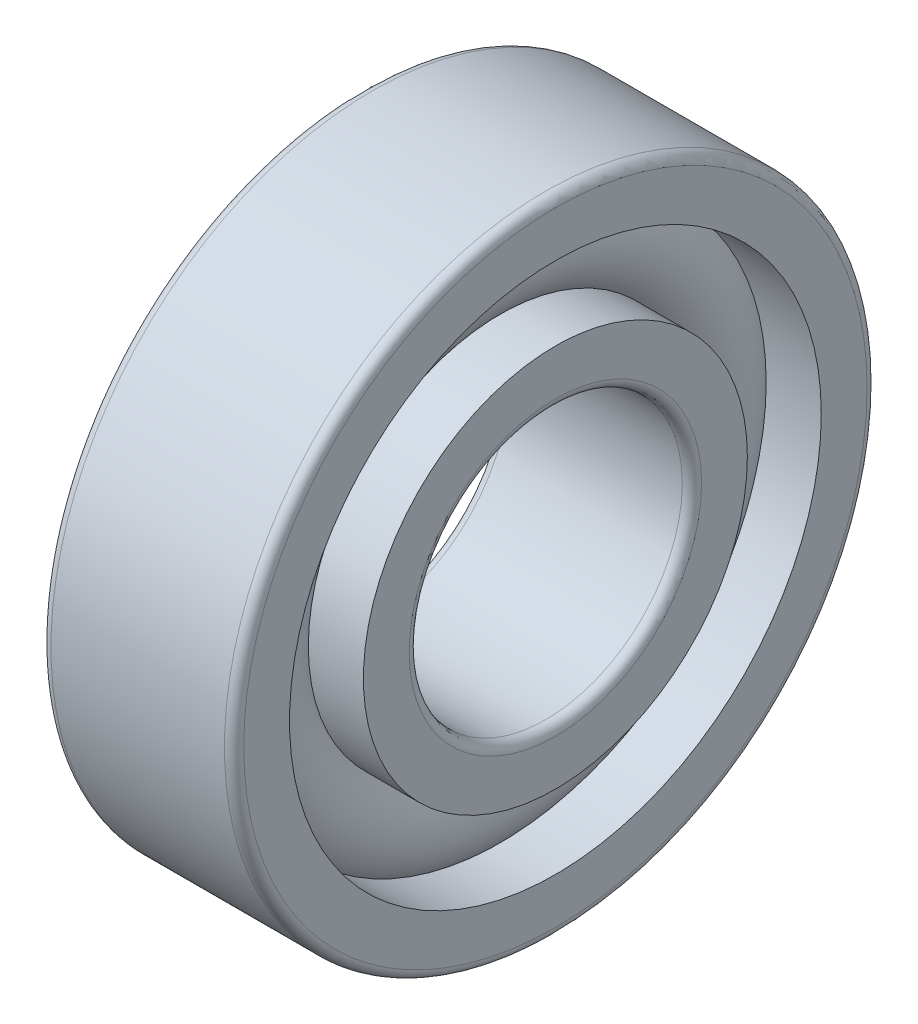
ISO-10303-21;
HEADER;
FILE_DESCRIPTION(('STEP AP214'),'2;1');
FILE_NAME('part.step','',(''),(''),'','','');
FILE_SCHEMA(('AUTOMOTIVE_DESIGN { 1 0 10303 214 1 1 1 1 }'));
ENDSEC;
DATA;
#1=APPLICATION_CONTEXT('core data for automotive mechanical design processes');
#2=APPLICATION_PROTOCOL_DEFINITION('international standard','automotive_design',2000,#1);
#3=PRODUCT_CONTEXT('',#1,'mechanical');
#4=PRODUCT('Part','Part','',(#3));
#5=PRODUCT_RELATED_PRODUCT_CATEGORY('part','',(#4));
#6=PRODUCT_DEFINITION_FORMATION('','',#4);
#7=PRODUCT_DEFINITION_CONTEXT('part definition',#1,'design');
#8=PRODUCT_DEFINITION('design','',#6,#7);
#9=PRODUCT_DEFINITION_SHAPE('','',#8);
#10=(LENGTH_UNIT() NAMED_UNIT(*) SI_UNIT(.MILLI.,.METRE.));
#11=(NAMED_UNIT(*) PLANE_ANGLE_UNIT() SI_UNIT($,.RADIAN.));
#12=(NAMED_UNIT(*) SI_UNIT($,.STERADIAN.) SOLID_ANGLE_UNIT());
#13=UNCERTAINTY_MEASURE_WITH_UNIT(LENGTH_MEASURE(1.E-05),#10,'distance_accuracy_value','');
#14=(GEOMETRIC_REPRESENTATION_CONTEXT(3) GLOBAL_UNCERTAINTY_ASSIGNED_CONTEXT((#13)) GLOBAL_UNIT_ASSIGNED_CONTEXT((#10,
#11,#12)) REPRESENTATION_CONTEXT('',''));
#15=CARTESIAN_POINT('',(0.,0.,0.));
#16=DIRECTION('',(0.,0.,1.));
#17=DIRECTION('',(1.,0.,0.));
#18=AXIS2_PLACEMENT_3D('',#15,#16,#17);
#19=CARTESIAN_POINT('',(0.,0.,0.));
#20=DIRECTION('',(-1.,0.,0.));
#21=DIRECTION('',(0.,0.,1.));
#22=AXIS2_PLACEMENT_3D('',#19,#20,#21);
#23=TOROIDAL_SURFACE('',#22,14.25,3.45);
#24=CARTESIAN_POINT('',(2.57147817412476,0.,0.));
#25=DIRECTION('',(-1.,0.,0.));
#26=DIRECTION('',(0.,0.,1.));
#27=AXIS2_PLACEMENT_3D('',#24,#25,#26);
#28=CIRCLE('',#27,16.55);
#29=CARTESIAN_POINT('',(2.57147817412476,0.,16.55));
#30=VERTEX_POINT('',#29);
#31=EDGE_CURVE('E33',#30,#30,#28,.F.);
#32=ORIENTED_EDGE('',*,*,#31,.T.);
#33=EDGE_LOOP('',(#32));
#34=FACE_BOUND('',#33,.T.);
#35=CARTESIAN_POINT('',(2.57147817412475,0.,0.));
#36=DIRECTION('',(-1.,0.,0.));
#37=DIRECTION('',(0.,0.,1.));
#38=AXIS2_PLACEMENT_3D('',#35,#36,#37);
#39=CIRCLE('',#38,11.95);
#40=CARTESIAN_POINT('',(2.57147817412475,0.,11.95));
#41=VERTEX_POINT('',#40);
#42=EDGE_CURVE('E10',#41,#41,#39,.T.);
#43=ORIENTED_EDGE('',*,*,#42,.T.);
#44=EDGE_LOOP('',(#43));
#45=FACE_BOUND('',#44,.T.);
#46=ADVANCED_FACE('F29',(#34,#45),#23,.T.);
#47=CARTESIAN_POINT('',(-20.6375,0.,0.));
#48=DIRECTION('',(1.,0.,0.));
#49=DIRECTION('',(0.,0.,-1.));
#50=AXIS2_PLACEMENT_3D('',#47,#48,#49);
#51=CYLINDRICAL_SURFACE('',#50,11.95);
#52=CARTESIAN_POINT('',(6.,0.,0.));
#53=DIRECTION('',(1.,0.,0.));
#54=DIRECTION('',(0.,0.,-1.));
#55=AXIS2_PLACEMENT_3D('',#52,#53,#54);
#56=CIRCLE('',#55,11.95);
#57=CARTESIAN_POINT('',(6.,0.,-11.95));
#58=VERTEX_POINT('',#57);
#59=EDGE_CURVE('E42',#58,#58,#56,.T.);
#60=ORIENTED_EDGE('',*,*,#59,.F.);
#61=EDGE_LOOP('',(#60));
#62=FACE_BOUND('',#61,.T.);
#63=ORIENTED_EDGE('',*,*,#42,.F.);
#64=EDGE_LOOP('',(#63));
#65=FACE_BOUND('',#64,.T.);
#66=ADVANCED_FACE('F81',(#62,#65),#51,.T.);
#67=CARTESIAN_POINT('',(-20.6375,0.,0.));
#68=DIRECTION('',(1.,0.,0.));
#69=DIRECTION('',(0.,0.,-1.));
#70=AXIS2_PLACEMENT_3D('',#67,#68,#69);
#71=CYLINDRICAL_SURFACE('',#70,11.95);
#72=CARTESIAN_POINT('',(-6.,0.,0.));
#73=DIRECTION('',(1.,0.,0.));
#74=DIRECTION('',(0.,0.,-1.));
#75=AXIS2_PLACEMENT_3D('',#72,#73,#74);
#76=CIRCLE('',#75,11.95);
#77=CARTESIAN_POINT('',(-6.,0.,-11.95));
#78=VERTEX_POINT('',#77);
#79=EDGE_CURVE('E51',#78,#78,#76,.T.);
#80=ORIENTED_EDGE('',*,*,#79,.T.);
#81=EDGE_LOOP('',(#80));
#82=FACE_BOUND('',#81,.T.);
#83=CARTESIAN_POINT('',(-2.57147817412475,0.,0.));
#84=DIRECTION('',(1.,0.,0.));
#85=DIRECTION('',(0.,0.,-1.));
#86=AXIS2_PLACEMENT_3D('',#83,#84,#85);
#87=CIRCLE('',#86,11.95);
#88=CARTESIAN_POINT('',(-2.57147817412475,0.,-11.95));
#89=VERTEX_POINT('',#88);
#90=EDGE_CURVE('E37',#89,#89,#87,.T.);
#91=ORIENTED_EDGE('',*,*,#90,.F.);
#92=EDGE_LOOP('',(#91));
#93=FACE_BOUND('',#92,.T.);
#94=ADVANCED_FACE('F84',(#82,#93),#71,.T.);
#95=CARTESIAN_POINT('',(6.,9.1,0.));
#96=DIRECTION('',(1.,0.,0.));
#97=DIRECTION('',(0.,0.,-1.));
#98=AXIS2_PLACEMENT_3D('',#95,#96,#97);
#99=PLANE('',#98);
#100=ORIENTED_EDGE('',*,*,#59,.T.);
#101=EDGE_LOOP('',(#100));
#102=FACE_BOUND('',#101,.T.);
#103=CARTESIAN_POINT('',(6.,0.,0.));
#104=DIRECTION('',(1.,0.,0.));
#105=DIRECTION('',(0.,0.,-1.));
#106=AXIS2_PLACEMENT_3D('',#103,#104,#105);
#107=CIRCLE('',#106,9.1);
#108=CARTESIAN_POINT('',(6.,0.,-9.1));
#109=VERTEX_POINT('',#108);
#110=EDGE_CURVE('E73',#109,#109,#107,.T.);
#111=ORIENTED_EDGE('',*,*,#110,.F.);
#112=EDGE_LOOP('',(#111));
#113=FACE_BOUND('',#112,.T.);
#114=ADVANCED_FACE('F78',(#102,#113),#99,.T.);
#115=CARTESIAN_POINT('',(5.4,0.,0.));
#116=DIRECTION('',(1.,0.,0.));
#117=DIRECTION('',(0.,0.,-1.));
#118=AXIS2_PLACEMENT_3D('',#115,#116,#117);
#119=TOROIDAL_SURFACE('',#118,9.1,0.6);
#120=ORIENTED_EDGE('',*,*,#110,.T.);
#121=EDGE_LOOP('',(#120));
#122=FACE_BOUND('',#121,.T.);
#123=CARTESIAN_POINT('',(5.4,0.,0.));
#124=DIRECTION('',(1.,0.,0.));
#125=DIRECTION('',(0.,0.,-1.));
#126=AXIS2_PLACEMENT_3D('',#123,#124,#125);
#127=CIRCLE('',#126,8.5);
#128=CARTESIAN_POINT('',(5.4,0.,-8.5));
#129=VERTEX_POINT('',#128);
#130=EDGE_CURVE('E70',#129,#129,#127,.T.);
#131=ORIENTED_EDGE('',*,*,#130,.F.);
#132=EDGE_LOOP('',(#131));
#133=FACE_BOUND('',#132,.T.);
#134=ADVANCED_FACE('F95',(#122,#133),#119,.T.);
#135=CARTESIAN_POINT('',(-20.6375,0.,0.));
#136=DIRECTION('',(1.,0.,0.));
#137=DIRECTION('',(0.,0.,-1.));
#138=AXIS2_PLACEMENT_3D('',#135,#136,#137);
#139=CYLINDRICAL_SURFACE('',#138,8.5);
#140=ORIENTED_EDGE('',*,*,#130,.T.);
#141=EDGE_LOOP('',(#140));
#142=FACE_BOUND('',#141,.T.);
#143=CARTESIAN_POINT('',(-5.4,0.,0.));
#144=DIRECTION('',(1.,0.,0.));
#145=DIRECTION('',(0.,0.,-1.));
#146=AXIS2_PLACEMENT_3D('',#143,#144,#145);
#147=CIRCLE('',#146,8.5);
#148=CARTESIAN_POINT('',(-5.4,0.,-8.5));
#149=VERTEX_POINT('',#148);
#150=EDGE_CURVE('E67',#149,#149,#147,.T.);
#151=ORIENTED_EDGE('',*,*,#150,.F.);
#152=EDGE_LOOP('',(#151));
#153=FACE_BOUND('',#152,.T.);
#154=ADVANCED_FACE('F98',(#142,#153),#139,.F.);
#155=CARTESIAN_POINT('',(-5.4,0.,0.));
#156=DIRECTION('',(1.,0.,0.));
#157=DIRECTION('',(0.,0.,-1.));
#158=AXIS2_PLACEMENT_3D('',#155,#156,#157);
#159=TOROIDAL_SURFACE('',#158,9.1,0.6);
#160=ORIENTED_EDGE('',*,*,#150,.T.);
#161=EDGE_LOOP('',(#160));
#162=FACE_BOUND('',#161,.T.);
#163=CARTESIAN_POINT('',(-6.,0.,0.));
#164=DIRECTION('',(1.,0.,0.));
#165=DIRECTION('',(0.,0.,-1.));
#166=AXIS2_PLACEMENT_3D('',#163,#164,#165);
#167=CIRCLE('',#166,9.1);
#168=CARTESIAN_POINT('',(-6.,0.,-9.1));
#169=VERTEX_POINT('',#168);
#170=EDGE_CURVE('E64',#169,#169,#167,.T.);
#171=ORIENTED_EDGE('',*,*,#170,.F.);
#172=EDGE_LOOP('',(#171));
#173=FACE_BOUND('',#172,.T.);
#174=ADVANCED_FACE('F102',(#162,#173),#159,.T.);
#175=CARTESIAN_POINT('',(-6.,11.95,0.));
#176=DIRECTION('',(-1.,0.,0.));
#177=DIRECTION('',(0.,0.,1.));
#178=AXIS2_PLACEMENT_3D('',#175,#176,#177);
#179=PLANE('',#178);
#180=ORIENTED_EDGE('',*,*,#170,.T.);
#181=EDGE_LOOP('',(#180));
#182=FACE_BOUND('',#181,.T.);
#183=ORIENTED_EDGE('',*,*,#79,.F.);
#184=EDGE_LOOP('',(#183));
#185=FACE_BOUND('',#184,.T.);
#186=ADVANCED_FACE('F106',(#182,#185),#179,.T.);
#187=CARTESIAN_POINT('',(-2.57147817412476,0.,0.));
#188=DIRECTION('',(1.,0.,0.));
#189=DIRECTION('',(0.,0.,-1.));
#190=AXIS2_PLACEMENT_3D('',#187,#188,#189);
#191=CIRCLE('',#190,16.55);
#192=CARTESIAN_POINT('',(-2.57147817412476,0.,-16.55));
#193=VERTEX_POINT('',#192);
#194=EDGE_CURVE('E45',#193,#193,#191,.F.);
#195=ORIENTED_EDGE('',*,*,#194,.T.);
#196=EDGE_LOOP('',(#195));
#197=FACE_BOUND('',#196,.T.);
#198=ORIENTED_EDGE('',*,*,#90,.T.);
#199=EDGE_LOOP('',(#198));
#200=FACE_BOUND('',#199,.T.);
#201=ADVANCED_FACE('F31',(#197,#200),#23,.T.);
#202=CARTESIAN_POINT('',(-20.6375,0.,0.));
#203=DIRECTION('',(1.,0.,0.));
#204=DIRECTION('',(0.,0.,-1.));
#205=AXIS2_PLACEMENT_3D('',#202,#203,#204);
#206=CYLINDRICAL_SURFACE('',#205,16.55);
#207=CARTESIAN_POINT('',(6.,0.,0.));
#208=DIRECTION('',(1.,0.,0.));
#209=DIRECTION('',(0.,0.,-1.));
#210=AXIS2_PLACEMENT_3D('',#207,#208,#209);
#211=CIRCLE('',#210,16.55);
#212=CARTESIAN_POINT('',(6.,0.,-16.55));
#213=VERTEX_POINT('',#212);
#214=EDGE_CURVE('E47',#213,#213,#211,.T.);
#215=ORIENTED_EDGE('',*,*,#214,.T.);
#216=EDGE_LOOP('',(#215));
#217=FACE_BOUND('',#216,.T.);
#218=ORIENTED_EDGE('',*,*,#31,.F.);
#219=EDGE_LOOP('',(#218));
#220=FACE_BOUND('',#219,.T.);
#221=ADVANCED_FACE('F111',(#217,#220),#206,.F.);
#222=CARTESIAN_POINT('',(-20.6375,0.,0.));
#223=DIRECTION('',(1.,0.,0.));
#224=DIRECTION('',(0.,0.,-1.));
#225=AXIS2_PLACEMENT_3D('',#222,#223,#224);
#226=CYLINDRICAL_SURFACE('',#225,16.55);
#227=CARTESIAN_POINT('',(-6.,0.,0.));
#228=DIRECTION('',(1.,0.,0.));
#229=DIRECTION('',(0.,0.,-1.));
#230=AXIS2_PLACEMENT_3D('',#227,#228,#229);
#231=CIRCLE('',#230,16.55);
#232=CARTESIAN_POINT('',(-6.,0.,-16.55));
#233=VERTEX_POINT('',#232);
#234=EDGE_CURVE('E142',#233,#233,#231,.T.);
#235=ORIENTED_EDGE('',*,*,#234,.F.);
#236=EDGE_LOOP('',(#235));
#237=FACE_BOUND('',#236,.T.);
#238=ORIENTED_EDGE('',*,*,#194,.F.);
#239=EDGE_LOOP('',(#238));
#240=FACE_BOUND('',#239,.T.);
#241=ADVANCED_FACE('F114',(#237,#240),#226,.F.);
#242=CARTESIAN_POINT('',(6.,19.4,0.));
#243=DIRECTION('',(1.,0.,0.));
#244=DIRECTION('',(0.,0.,-1.));
#245=AXIS2_PLACEMENT_3D('',#242,#243,#244);
#246=PLANE('',#245);
#247=CARTESIAN_POINT('',(6.,0.,0.));
#248=DIRECTION('',(1.,0.,0.));
#249=DIRECTION('',(0.,0.,-1.));
#250=AXIS2_PLACEMENT_3D('',#247,#248,#249);
#251=CIRCLE('',#250,19.4);
#252=CARTESIAN_POINT('',(6.,0.,-19.4));
#253=VERTEX_POINT('',#252);
#254=EDGE_CURVE('E53',#253,#253,#251,.T.);
#255=ORIENTED_EDGE('',*,*,#254,.T.);
#256=EDGE_LOOP('',(#255));
#257=FACE_BOUND('',#256,.T.);
#258=ORIENTED_EDGE('',*,*,#214,.F.);
#259=EDGE_LOOP('',(#258));
#260=FACE_BOUND('',#259,.T.);
#261=ADVANCED_FACE('F115',(#257,#260),#246,.T.);
#262=CARTESIAN_POINT('',(5.4,0.,0.));
#263=DIRECTION('',(1.,0.,0.));
#264=DIRECTION('',(0.,0.,-1.));
#265=AXIS2_PLACEMENT_3D('',#262,#263,#264);
#266=TOROIDAL_SURFACE('',#265,19.4,0.600000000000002);
#267=CARTESIAN_POINT('',(5.4,0.,0.));
#268=DIRECTION('',(1.,0.,0.));
#269=DIRECTION('',(0.,0.,-1.));
#270=AXIS2_PLACEMENT_3D('',#267,#268,#269);
#271=CIRCLE('',#270,20.);
#272=CARTESIAN_POINT('',(5.4,0.,-20.));
#273=VERTEX_POINT('',#272);
#274=EDGE_CURVE('E58',#273,#273,#271,.T.);
#275=ORIENTED_EDGE('',*,*,#274,.T.);
#276=EDGE_LOOP('',(#275));
#277=FACE_BOUND('',#276,.T.);
#278=ORIENTED_EDGE('',*,*,#254,.F.);
#279=EDGE_LOOP('',(#278));
#280=FACE_BOUND('',#279,.T.);
#281=ADVANCED_FACE('F118',(#277,#280),#266,.T.);
#282=CARTESIAN_POINT('',(-20.6375,0.,0.));
#283=DIRECTION('',(1.,0.,0.));
#284=DIRECTION('',(0.,0.,-1.));
#285=AXIS2_PLACEMENT_3D('',#282,#283,#284);
#286=CYLINDRICAL_SURFACE('',#285,20.);
#287=CARTESIAN_POINT('',(-5.4,0.,0.));
#288=DIRECTION('',(1.,0.,0.));
#289=DIRECTION('',(0.,0.,-1.));
#290=AXIS2_PLACEMENT_3D('',#287,#288,#289);
#291=CIRCLE('',#290,20.);
#292=CARTESIAN_POINT('',(-5.4,0.,-20.));
#293=VERTEX_POINT('',#292);
#294=EDGE_CURVE('E146',#293,#293,#291,.T.);
#295=ORIENTED_EDGE('',*,*,#294,.T.);
#296=EDGE_LOOP('',(#295));
#297=FACE_BOUND('',#296,.T.);
#298=ORIENTED_EDGE('',*,*,#274,.F.);
#299=EDGE_LOOP('',(#298));
#300=FACE_BOUND('',#299,.T.);
#301=ADVANCED_FACE('F122',(#297,#300),#286,.T.);
#302=CARTESIAN_POINT('',(-5.4,0.,0.));
#303=DIRECTION('',(1.,0.,0.));
#304=DIRECTION('',(0.,0.,-1.));
#305=AXIS2_PLACEMENT_3D('',#302,#303,#304);
#306=TOROIDAL_SURFACE('',#305,19.4,0.600000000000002);
#307=CARTESIAN_POINT('',(-6.,0.,0.));
#308=DIRECTION('',(1.,0.,0.));
#309=DIRECTION('',(0.,0.,-1.));
#310=AXIS2_PLACEMENT_3D('',#307,#308,#309);
#311=CIRCLE('',#310,19.4);
#312=CARTESIAN_POINT('',(-6.,0.,-19.4));
#313=VERTEX_POINT('',#312);
#314=EDGE_CURVE('E143',#313,#313,#311,.T.);
#315=ORIENTED_EDGE('',*,*,#314,.T.);
#316=EDGE_LOOP('',(#315));
#317=FACE_BOUND('',#316,.T.);
#318=ORIENTED_EDGE('',*,*,#294,.F.);
#319=EDGE_LOOP('',(#318));
#320=FACE_BOUND('',#319,.T.);
#321=ADVANCED_FACE('F126',(#317,#320),#306,.T.);
#322=CARTESIAN_POINT('',(-6.,16.55,0.));
#323=DIRECTION('',(-1.,0.,0.));
#324=DIRECTION('',(0.,0.,1.));
#325=AXIS2_PLACEMENT_3D('',#322,#323,#324);
#326=PLANE('',#325);
#327=ORIENTED_EDGE('',*,*,#234,.T.);
#328=EDGE_LOOP('',(#327));
#329=FACE_BOUND('',#328,.T.);
#330=ORIENTED_EDGE('',*,*,#314,.F.);
#331=EDGE_LOOP('',(#330));
#332=FACE_BOUND('',#331,.T.);
#333=ADVANCED_FACE('F130',(#329,#332),#326,.T.);
#334=CLOSED_SHELL('',(#46,#66,#94,#114,#134,#154,#174,#186,#201,#221,#241,#261,#281,#301,#321,#333));
#335=MANIFOLD_SOLID_BREP('B2',#334);
#336=ADVANCED_BREP_SHAPE_REPRESENTATION('',(#18,#335),#14);
#337=SHAPE_DEFINITION_REPRESENTATION(#9,#336);
ENDSEC;
END-ISO-10303-21;
